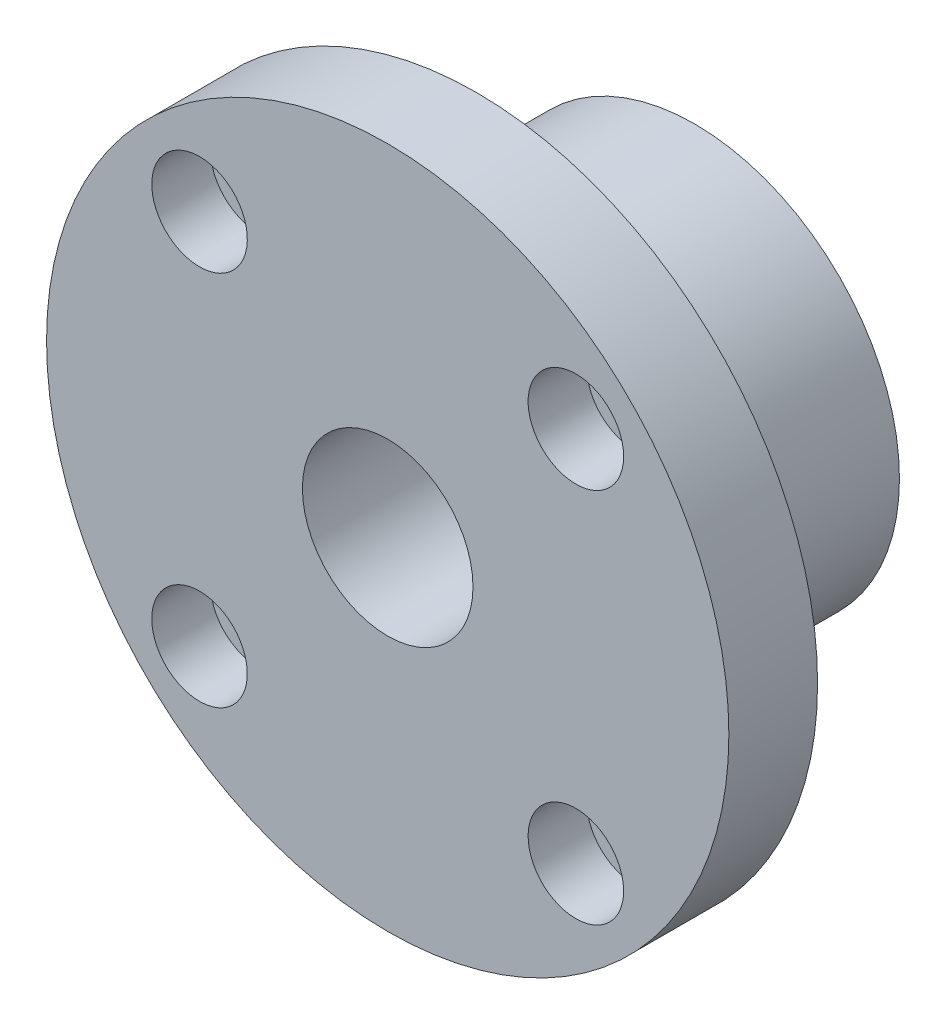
ISO-10303-21;
HEADER;
FILE_DESCRIPTION(('STEP AP214'),'2;1');
FILE_NAME('part.step','',(''),(''),'','','');
FILE_SCHEMA(('AUTOMOTIVE_DESIGN { 1 0 10303 214 1 1 1 1 }'));
ENDSEC;
DATA;
#1=APPLICATION_CONTEXT('core data for automotive mechanical design processes');
#2=APPLICATION_PROTOCOL_DEFINITION('international standard','automotive_design',2000,#1);
#3=PRODUCT_CONTEXT('',#1,'mechanical');
#4=PRODUCT('Part','Part','',(#3));
#5=PRODUCT_RELATED_PRODUCT_CATEGORY('part','',(#4));
#6=PRODUCT_DEFINITION_FORMATION('','',#4);
#7=PRODUCT_DEFINITION_CONTEXT('part definition',#1,'design');
#8=PRODUCT_DEFINITION('design','',#6,#7);
#9=PRODUCT_DEFINITION_SHAPE('','',#8);
#10=(LENGTH_UNIT() NAMED_UNIT(*) SI_UNIT(.MILLI.,.METRE.));
#11=(NAMED_UNIT(*) PLANE_ANGLE_UNIT() SI_UNIT($,.RADIAN.));
#12=(NAMED_UNIT(*) SI_UNIT($,.STERADIAN.) SOLID_ANGLE_UNIT());
#13=UNCERTAINTY_MEASURE_WITH_UNIT(LENGTH_MEASURE(1.E-05),#10,'distance_accuracy_value','');
#14=(GEOMETRIC_REPRESENTATION_CONTEXT(3) GLOBAL_UNCERTAINTY_ASSIGNED_CONTEXT((#13)) GLOBAL_UNIT_ASSIGNED_CONTEXT((#10,
#11,#12)) REPRESENTATION_CONTEXT('',''));
#15=CARTESIAN_POINT('',(0.,0.,0.));
#16=DIRECTION('',(0.,0.,1.));
#17=DIRECTION('',(1.,0.,0.));
#18=AXIS2_PLACEMENT_3D('',#15,#16,#17);
#19=CARTESIAN_POINT('',(0.,0.,0.));
#20=DIRECTION('',(0.,0.,1.));
#21=DIRECTION('',(1.,0.,0.));
#22=AXIS2_PLACEMENT_3D('',#19,#20,#21);
#23=PLANE('',#22);
#24=CARTESIAN_POINT('',(0.,0.,0.));
#25=DIRECTION('',(0.,0.,1.));
#26=DIRECTION('',(1.,0.,0.));
#27=AXIS2_PLACEMENT_3D('',#24,#25,#26);
#28=CIRCLE('',#27,50.);
#29=CARTESIAN_POINT('',(50.,0.,0.));
#30=VERTEX_POINT('',#29);
#31=EDGE_CURVE('E23',#30,#30,#28,.T.);
#32=ORIENTED_EDGE('',*,*,#31,.F.);
#33=EDGE_LOOP('',(#32));
#34=FACE_BOUND('',#33,.T.);
#35=CARTESIAN_POINT('',(27.5771644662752,27.5771644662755,0.));
#36=DIRECTION('',(0.,0.,1.));
#37=DIRECTION('',(1.,0.,0.));
#38=AXIS2_PLACEMENT_3D('',#35,#36,#37);
#39=CIRCLE('',#38,5.);
#40=CARTESIAN_POINT('',(32.5771644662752,27.5771644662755,0.));
#41=VERTEX_POINT('',#40);
#42=EDGE_CURVE('E35',#41,#41,#39,.T.);
#43=ORIENTED_EDGE('',*,*,#42,.T.);
#44=EDGE_LOOP('',(#43));
#45=FACE_BOUND('',#44,.T.);
#46=CARTESIAN_POINT('',(27.5771644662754,-27.5771644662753,0.));
#47=DIRECTION('',(0.,0.,1.));
#48=DIRECTION('',(0.,-1.,0.));
#49=AXIS2_PLACEMENT_3D('',#46,#47,#48);
#50=CIRCLE('',#49,5.);
#51=CARTESIAN_POINT('',(27.5771644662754,-32.5771644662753,0.));
#52=VERTEX_POINT('',#51);
#53=EDGE_CURVE('E75',#52,#52,#50,.T.);
#54=ORIENTED_EDGE('',*,*,#53,.T.);
#55=EDGE_LOOP('',(#54));
#56=FACE_BOUND('',#55,.T.);
#57=CARTESIAN_POINT('',(-27.5771644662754,-27.5771644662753,0.));
#58=DIRECTION('',(0.,0.,1.));
#59=DIRECTION('',(-1.,0.,0.));
#60=AXIS2_PLACEMENT_3D('',#57,#58,#59);
#61=CIRCLE('',#60,5.);
#62=CARTESIAN_POINT('',(-32.5771644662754,-27.5771644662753,0.));
#63=VERTEX_POINT('',#62);
#64=EDGE_CURVE('E72',#63,#63,#61,.T.);
#65=ORIENTED_EDGE('',*,*,#64,.T.);
#66=EDGE_LOOP('',(#65));
#67=FACE_BOUND('',#66,.T.);
#68=CARTESIAN_POINT('',(-27.5771644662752,27.5771644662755,0.));
#69=DIRECTION('',(0.,0.,1.));
#70=DIRECTION('',(0.,1.,0.));
#71=AXIS2_PLACEMENT_3D('',#68,#69,#70);
#72=CIRCLE('',#71,5.);
#73=CARTESIAN_POINT('',(-27.5771644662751,32.5771644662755,0.));
#74=VERTEX_POINT('',#73);
#75=EDGE_CURVE('E40',#74,#74,#72,.T.);
#76=ORIENTED_EDGE('',*,*,#75,.T.);
#77=EDGE_LOOP('',(#76));
#78=FACE_BOUND('',#77,.T.);
#79=CARTESIAN_POINT('',(0.,0.,0.));
#80=DIRECTION('',(0.,0.,1.));
#81=DIRECTION('',(1.,0.,0.));
#82=AXIS2_PLACEMENT_3D('',#79,#80,#81);
#83=CIRCLE('',#82,30.);
#84=CARTESIAN_POINT('',(30.,0.,0.));
#85=VERTEX_POINT('',#84);
#86=EDGE_CURVE('E8',#85,#85,#83,.F.);
#87=ORIENTED_EDGE('',*,*,#86,.F.);
#88=EDGE_LOOP('',(#87));
#89=FACE_BOUND('',#88,.T.);
#90=ADVANCED_FACE('F12',(#34,#45,#56,#67,#78,#89),#23,.F.);
#91=CARTESIAN_POINT('',(-27.5771644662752,27.5771644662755,0.));
#92=DIRECTION('',(0.,0.,1.));
#93=DIRECTION('',(1.,0.,0.));
#94=AXIS2_PLACEMENT_3D('',#91,#92,#93);
#95=CYLINDRICAL_SURFACE('',#94,5.);
#96=ORIENTED_EDGE('',*,*,#75,.F.);
#97=EDGE_LOOP('',(#96));
#98=FACE_BOUND('',#97,.T.);
#99=CARTESIAN_POINT('',(-27.5771644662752,27.5771644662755,4.4));
#100=DIRECTION('',(0.,0.,1.));
#101=DIRECTION('',(1.,0.,0.));
#102=AXIS2_PLACEMENT_3D('',#99,#100,#101);
#103=CIRCLE('',#102,5.);
#104=CARTESIAN_POINT('',(-22.5771644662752,27.5771644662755,4.4));
#105=VERTEX_POINT('',#104);
#106=EDGE_CURVE('E46',#105,#105,#103,.F.);
#107=ORIENTED_EDGE('',*,*,#106,.F.);
#108=EDGE_LOOP('',(#107));
#109=FACE_BOUND('',#108,.T.);
#110=ADVANCED_FACE('F120',(#98,#109),#95,.F.);
#111=CARTESIAN_POINT('',(-27.5771644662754,-27.5771644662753,0.));
#112=DIRECTION('',(0.,0.,1.));
#113=DIRECTION('',(1.,0.,0.));
#114=AXIS2_PLACEMENT_3D('',#111,#112,#113);
#115=CYLINDRICAL_SURFACE('',#114,5.);
#116=ORIENTED_EDGE('',*,*,#64,.F.);
#117=EDGE_LOOP('',(#116));
#118=FACE_BOUND('',#117,.T.);
#119=CARTESIAN_POINT('',(-27.5771644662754,-27.5771644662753,4.4));
#120=DIRECTION('',(0.,0.,1.));
#121=DIRECTION('',(1.,0.,0.));
#122=AXIS2_PLACEMENT_3D('',#119,#120,#121);
#123=CIRCLE('',#122,5.);
#124=CARTESIAN_POINT('',(-22.5771644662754,-27.5771644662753,4.4));
#125=VERTEX_POINT('',#124);
#126=EDGE_CURVE('E42',#125,#125,#123,.F.);
#127=ORIENTED_EDGE('',*,*,#126,.F.);
#128=EDGE_LOOP('',(#127));
#129=FACE_BOUND('',#128,.T.);
#130=ADVANCED_FACE('F126',(#118,#129),#115,.F.);
#131=CARTESIAN_POINT('',(27.5771644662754,-27.5771644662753,0.));
#132=DIRECTION('',(0.,0.,1.));
#133=DIRECTION('',(1.,0.,0.));
#134=AXIS2_PLACEMENT_3D('',#131,#132,#133);
#135=CYLINDRICAL_SURFACE('',#134,5.);
#136=ORIENTED_EDGE('',*,*,#53,.F.);
#137=EDGE_LOOP('',(#136));
#138=FACE_BOUND('',#137,.T.);
#139=CARTESIAN_POINT('',(27.5771644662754,-27.5771644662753,4.4));
#140=DIRECTION('',(0.,0.,1.));
#141=DIRECTION('',(1.,0.,0.));
#142=AXIS2_PLACEMENT_3D('',#139,#140,#141);
#143=CIRCLE('',#142,5.);
#144=CARTESIAN_POINT('',(32.5771644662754,-27.5771644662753,4.4));
#145=VERTEX_POINT('',#144);
#146=EDGE_CURVE('E37',#145,#145,#143,.F.);
#147=ORIENTED_EDGE('',*,*,#146,.F.);
#148=EDGE_LOOP('',(#147));
#149=FACE_BOUND('',#148,.T.);
#150=ADVANCED_FACE('F137',(#138,#149),#135,.F.);
#151=CARTESIAN_POINT('',(27.5771644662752,27.5771644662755,0.));
#152=DIRECTION('',(0.,0.,1.));
#153=DIRECTION('',(1.,0.,0.));
#154=AXIS2_PLACEMENT_3D('',#151,#152,#153);
#155=CYLINDRICAL_SURFACE('',#154,5.);
#156=ORIENTED_EDGE('',*,*,#42,.F.);
#157=EDGE_LOOP('',(#156));
#158=FACE_BOUND('',#157,.T.);
#159=CARTESIAN_POINT('',(27.5771644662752,27.5771644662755,4.4));
#160=DIRECTION('',(0.,0.,1.));
#161=DIRECTION('',(1.,0.,0.));
#162=AXIS2_PLACEMENT_3D('',#159,#160,#161);
#163=CIRCLE('',#162,5.);
#164=CARTESIAN_POINT('',(32.5771644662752,27.5771644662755,4.4));
#165=VERTEX_POINT('',#164);
#166=EDGE_CURVE('E32',#165,#165,#163,.F.);
#167=ORIENTED_EDGE('',*,*,#166,.F.);
#168=EDGE_LOOP('',(#167));
#169=FACE_BOUND('',#168,.T.);
#170=ADVANCED_FACE('F92',(#158,#169),#155,.F.);
#171=CARTESIAN_POINT('',(0.,0.,13.));
#172=DIRECTION('',(0.,0.,1.));
#173=DIRECTION('',(1.,0.,0.));
#174=AXIS2_PLACEMENT_3D('',#171,#172,#173);
#175=PLANE('',#174);
#176=CARTESIAN_POINT('',(0.,0.,13.));
#177=DIRECTION('',(0.,0.,1.));
#178=DIRECTION('',(1.,0.,0.));
#179=AXIS2_PLACEMENT_3D('',#176,#177,#178);
#180=CIRCLE('',#179,12.5);
#181=CARTESIAN_POINT('',(12.5,0.,13.));
#182=VERTEX_POINT('',#181);
#183=EDGE_CURVE('E28',#182,#182,#180,.T.);
#184=ORIENTED_EDGE('',*,*,#183,.F.);
#185=EDGE_LOOP('',(#184));
#186=FACE_BOUND('',#185,.T.);
#187=CARTESIAN_POINT('',(0.,0.,13.));
#188=DIRECTION('',(0.,0.,1.));
#189=DIRECTION('',(1.,0.,0.));
#190=AXIS2_PLACEMENT_3D('',#187,#188,#189);
#191=CIRCLE('',#190,50.);
#192=CARTESIAN_POINT('',(50.,0.,13.));
#193=VERTEX_POINT('',#192);
#194=EDGE_CURVE('E19',#193,#193,#191,.T.);
#195=ORIENTED_EDGE('',*,*,#194,.T.);
#196=EDGE_LOOP('',(#195));
#197=FACE_BOUND('',#196,.T.);
#198=CARTESIAN_POINT('',(27.5771644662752,27.5771644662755,13.));
#199=DIRECTION('',(0.,0.,1.));
#200=DIRECTION('',(1.,0.,0.));
#201=AXIS2_PLACEMENT_3D('',#198,#199,#200);
#202=CIRCLE('',#201,7.);
#203=CARTESIAN_POINT('',(34.5771644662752,27.5771644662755,13.));
#204=VERTEX_POINT('',#203);
#205=EDGE_CURVE('E78',#204,#204,#202,.T.);
#206=ORIENTED_EDGE('',*,*,#205,.F.);
#207=EDGE_LOOP('',(#206));
#208=FACE_BOUND('',#207,.T.);
#209=CARTESIAN_POINT('',(27.5771644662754,-27.5771644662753,13.));
#210=DIRECTION('',(0.,0.,1.));
#211=DIRECTION('',(0.,-1.,0.));
#212=AXIS2_PLACEMENT_3D('',#209,#210,#211);
#213=CIRCLE('',#212,7.);
#214=CARTESIAN_POINT('',(27.5771644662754,-34.5771644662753,13.));
#215=VERTEX_POINT('',#214);
#216=EDGE_CURVE('E44',#215,#215,#213,.T.);
#217=ORIENTED_EDGE('',*,*,#216,.F.);
#218=EDGE_LOOP('',(#217));
#219=FACE_BOUND('',#218,.T.);
#220=CARTESIAN_POINT('',(-27.5771644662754,-27.5771644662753,13.));
#221=DIRECTION('',(0.,0.,1.));
#222=DIRECTION('',(-1.,0.,0.));
#223=AXIS2_PLACEMENT_3D('',#220,#221,#222);
#224=CIRCLE('',#223,7.);
#225=CARTESIAN_POINT('',(-34.5771644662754,-27.5771644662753,13.));
#226=VERTEX_POINT('',#225);
#227=EDGE_CURVE('E48',#226,#226,#224,.T.);
#228=ORIENTED_EDGE('',*,*,#227,.F.);
#229=EDGE_LOOP('',(#228));
#230=FACE_BOUND('',#229,.T.);
#231=CARTESIAN_POINT('',(-27.5771644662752,27.5771644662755,13.));
#232=DIRECTION('',(0.,0.,1.));
#233=DIRECTION('',(0.,1.,0.));
#234=AXIS2_PLACEMENT_3D('',#231,#232,#233);
#235=CIRCLE('',#234,7.);
#236=CARTESIAN_POINT('',(-27.5771644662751,34.5771644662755,13.));
#237=VERTEX_POINT('',#236);
#238=EDGE_CURVE('E55',#237,#237,#235,.T.);
#239=ORIENTED_EDGE('',*,*,#238,.F.);
#240=EDGE_LOOP('',(#239));
#241=FACE_BOUND('',#240,.T.);
#242=ADVANCED_FACE('F90',(#186,#197,#208,#219,#230,#241),#175,.T.);
#243=CARTESIAN_POINT('',(0.,0.,13.));
#244=DIRECTION('',(0.,0.,-1.));
#245=DIRECTION('',(-1.,0.,0.));
#246=AXIS2_PLACEMENT_3D('',#243,#244,#245);
#247=CYLINDRICAL_SURFACE('',#246,50.);
#248=ORIENTED_EDGE('',*,*,#194,.F.);
#249=EDGE_LOOP('',(#248));
#250=FACE_BOUND('',#249,.T.);
#251=ORIENTED_EDGE('',*,*,#31,.T.);
#252=EDGE_LOOP('',(#251));
#253=FACE_BOUND('',#252,.T.);
#254=ADVANCED_FACE('F14',(#250,#253),#247,.T.);
#255=CARTESIAN_POINT('',(0.,0.,13.));
#256=DIRECTION('',(0.,0.,-1.));
#257=DIRECTION('',(-1.,0.,0.));
#258=AXIS2_PLACEMENT_3D('',#255,#256,#257);
#259=CYLINDRICAL_SURFACE('',#258,12.5);
#260=ORIENTED_EDGE('',*,*,#183,.T.);
#261=EDGE_LOOP('',(#260));
#262=FACE_BOUND('',#261,.T.);
#263=CARTESIAN_POINT('',(0.,0.,-32.));
#264=DIRECTION('',(0.,0.,-1.));
#265=DIRECTION('',(-1.,0.,0.));
#266=AXIS2_PLACEMENT_3D('',#263,#264,#265);
#267=CIRCLE('',#266,12.5);
#268=CARTESIAN_POINT('',(-12.5,0.,-32.));
#269=VERTEX_POINT('',#268);
#270=EDGE_CURVE('E292',#269,#269,#267,.T.);
#271=ORIENTED_EDGE('',*,*,#270,.T.);
#272=EDGE_LOOP('',(#271));
#273=FACE_BOUND('',#272,.T.);
#274=ADVANCED_FACE('F87',(#262,#273),#259,.F.);
#275=CARTESIAN_POINT('',(27.5771644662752,27.5771644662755,4.4));
#276=DIRECTION('',(0.,0.,1.));
#277=DIRECTION('',(1.,0.,0.));
#278=AXIS2_PLACEMENT_3D('',#275,#276,#277);
#279=PLANE('',#278);
#280=CARTESIAN_POINT('',(27.5771644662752,27.5771644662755,4.4));
#281=DIRECTION('',(0.,0.,1.));
#282=DIRECTION('',(1.,0.,0.));
#283=AXIS2_PLACEMENT_3D('',#280,#281,#282);
#284=CIRCLE('',#283,7.);
#285=CARTESIAN_POINT('',(34.5771644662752,27.5771644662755,4.4));
#286=VERTEX_POINT('',#285);
#287=EDGE_CURVE('E36',#286,#286,#284,.T.);
#288=ORIENTED_EDGE('',*,*,#287,.T.);
#289=EDGE_LOOP('',(#288));
#290=FACE_BOUND('',#289,.T.);
#291=ORIENTED_EDGE('',*,*,#166,.T.);
#292=EDGE_LOOP('',(#291));
#293=FACE_BOUND('',#292,.T.);
#294=ADVANCED_FACE('F134',(#290,#293),#279,.T.);
#295=CARTESIAN_POINT('',(27.5771644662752,27.5771644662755,4.4));
#296=DIRECTION('',(0.,0.,1.));
#297=DIRECTION('',(1.,0.,0.));
#298=AXIS2_PLACEMENT_3D('',#295,#296,#297);
#299=CYLINDRICAL_SURFACE('',#298,7.);
#300=ORIENTED_EDGE('',*,*,#287,.F.);
#301=EDGE_LOOP('',(#300));
#302=FACE_BOUND('',#301,.T.);
#303=ORIENTED_EDGE('',*,*,#205,.T.);
#304=EDGE_LOOP('',(#303));
#305=FACE_BOUND('',#304,.T.);
#306=ADVANCED_FACE('F139',(#302,#305),#299,.F.);
#307=CARTESIAN_POINT('',(27.5771644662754,-27.5771644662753,4.4));
#308=DIRECTION('',(0.,0.,1.));
#309=DIRECTION('',(0.,-1.,0.));
#310=AXIS2_PLACEMENT_3D('',#307,#308,#309);
#311=PLANE('',#310);
#312=CARTESIAN_POINT('',(27.5771644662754,-27.5771644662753,4.4));
#313=DIRECTION('',(0.,0.,1.));
#314=DIRECTION('',(0.,-1.,0.));
#315=AXIS2_PLACEMENT_3D('',#312,#313,#314);
#316=CIRCLE('',#315,7.);
#317=CARTESIAN_POINT('',(27.5771644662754,-34.5771644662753,4.4));
#318=VERTEX_POINT('',#317);
#319=EDGE_CURVE('E41',#318,#318,#316,.T.);
#320=ORIENTED_EDGE('',*,*,#319,.T.);
#321=EDGE_LOOP('',(#320));
#322=FACE_BOUND('',#321,.T.);
#323=ORIENTED_EDGE('',*,*,#146,.T.);
#324=EDGE_LOOP('',(#323));
#325=FACE_BOUND('',#324,.T.);
#326=ADVANCED_FACE('F142',(#322,#325),#311,.T.);
#327=CARTESIAN_POINT('',(27.5771644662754,-27.5771644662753,4.4));
#328=DIRECTION('',(0.,0.,1.));
#329=DIRECTION('',(1.,0.,0.));
#330=AXIS2_PLACEMENT_3D('',#327,#328,#329);
#331=CYLINDRICAL_SURFACE('',#330,7.);
#332=ORIENTED_EDGE('',*,*,#319,.F.);
#333=EDGE_LOOP('',(#332));
#334=FACE_BOUND('',#333,.T.);
#335=ORIENTED_EDGE('',*,*,#216,.T.);
#336=EDGE_LOOP('',(#335));
#337=FACE_BOUND('',#336,.T.);
#338=ADVANCED_FACE('F153',(#334,#337),#331,.F.);
#339=CARTESIAN_POINT('',(-27.5771644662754,-27.5771644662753,4.4));
#340=DIRECTION('',(0.,0.,1.));
#341=DIRECTION('',(-1.,0.,0.));
#342=AXIS2_PLACEMENT_3D('',#339,#340,#341);
#343=PLANE('',#342);
#344=CARTESIAN_POINT('',(-27.5771644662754,-27.5771644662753,4.4));
#345=DIRECTION('',(0.,0.,1.));
#346=DIRECTION('',(-1.,0.,0.));
#347=AXIS2_PLACEMENT_3D('',#344,#345,#346);
#348=CIRCLE('',#347,7.);
#349=CARTESIAN_POINT('',(-34.5771644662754,-27.5771644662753,4.4));
#350=VERTEX_POINT('',#349);
#351=EDGE_CURVE('E45',#350,#350,#348,.T.);
#352=ORIENTED_EDGE('',*,*,#351,.T.);
#353=EDGE_LOOP('',(#352));
#354=FACE_BOUND('',#353,.T.);
#355=ORIENTED_EDGE('',*,*,#126,.T.);
#356=EDGE_LOOP('',(#355));
#357=FACE_BOUND('',#356,.T.);
#358=ADVANCED_FACE('F156',(#354,#357),#343,.T.);
#359=CARTESIAN_POINT('',(-27.5771644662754,-27.5771644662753,4.4));
#360=DIRECTION('',(0.,0.,1.));
#361=DIRECTION('',(1.,0.,0.));
#362=AXIS2_PLACEMENT_3D('',#359,#360,#361);
#363=CYLINDRICAL_SURFACE('',#362,7.);
#364=ORIENTED_EDGE('',*,*,#351,.F.);
#365=EDGE_LOOP('',(#364));
#366=FACE_BOUND('',#365,.T.);
#367=ORIENTED_EDGE('',*,*,#227,.T.);
#368=EDGE_LOOP('',(#367));
#369=FACE_BOUND('',#368,.T.);
#370=ADVANCED_FACE('F116',(#366,#369),#363,.F.);
#371=CARTESIAN_POINT('',(-27.5771644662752,27.5771644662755,4.4));
#372=DIRECTION('',(0.,0.,1.));
#373=DIRECTION('',(0.,1.,0.));
#374=AXIS2_PLACEMENT_3D('',#371,#372,#373);
#375=PLANE('',#374);
#376=CARTESIAN_POINT('',(-27.5771644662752,27.5771644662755,4.4));
#377=DIRECTION('',(0.,0.,1.));
#378=DIRECTION('',(0.,1.,0.));
#379=AXIS2_PLACEMENT_3D('',#376,#377,#378);
#380=CIRCLE('',#379,7.);
#381=CARTESIAN_POINT('',(-27.5771644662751,34.5771644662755,4.4));
#382=VERTEX_POINT('',#381);
#383=EDGE_CURVE('E49',#382,#382,#380,.T.);
#384=ORIENTED_EDGE('',*,*,#383,.T.);
#385=EDGE_LOOP('',(#384));
#386=FACE_BOUND('',#385,.T.);
#387=ORIENTED_EDGE('',*,*,#106,.T.);
#388=EDGE_LOOP('',(#387));
#389=FACE_BOUND('',#388,.T.);
#390=ADVANCED_FACE('F105',(#386,#389),#375,.T.);
#391=CARTESIAN_POINT('',(-27.5771644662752,27.5771644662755,4.4));
#392=DIRECTION('',(0.,0.,1.));
#393=DIRECTION('',(1.,0.,0.));
#394=AXIS2_PLACEMENT_3D('',#391,#392,#393);
#395=CYLINDRICAL_SURFACE('',#394,7.);
#396=ORIENTED_EDGE('',*,*,#383,.F.);
#397=EDGE_LOOP('',(#396));
#398=FACE_BOUND('',#397,.T.);
#399=ORIENTED_EDGE('',*,*,#238,.T.);
#400=EDGE_LOOP('',(#399));
#401=FACE_BOUND('',#400,.T.);
#402=ADVANCED_FACE('F102',(#398,#401),#395,.F.);
#403=CARTESIAN_POINT('',(0.,0.,-32.));
#404=DIRECTION('',(0.,0.,1.));
#405=DIRECTION('',(1.,0.,0.));
#406=AXIS2_PLACEMENT_3D('',#403,#404,#405);
#407=CYLINDRICAL_SURFACE('',#406,30.);
#408=CARTESIAN_POINT('',(0.,0.,-32.));
#409=DIRECTION('',(0.,0.,-1.));
#410=DIRECTION('',(-1.,0.,0.));
#411=AXIS2_PLACEMENT_3D('',#408,#409,#410);
#412=CIRCLE('',#411,30.);
#413=CARTESIAN_POINT('',(-30.,0.,-32.));
#414=VERTEX_POINT('',#413);
#415=EDGE_CURVE('E60',#414,#414,#412,.T.);
#416=ORIENTED_EDGE('',*,*,#415,.F.);
#417=EDGE_LOOP('',(#416));
#418=FACE_BOUND('',#417,.T.);
#419=ORIENTED_EDGE('',*,*,#86,.T.);
#420=EDGE_LOOP('',(#419));
#421=FACE_BOUND('',#420,.T.);
#422=ADVANCED_FACE('F104',(#418,#421),#407,.T.);
#423=CARTESIAN_POINT('',(0.,0.,-32.));
#424=DIRECTION('',(0.,0.,-1.));
#425=DIRECTION('',(-1.,0.,0.));
#426=AXIS2_PLACEMENT_3D('',#423,#424,#425);
#427=PLANE('',#426);
#428=ORIENTED_EDGE('',*,*,#415,.T.);
#429=EDGE_LOOP('',(#428));
#430=FACE_BOUND('',#429,.T.);
#431=ORIENTED_EDGE('',*,*,#270,.F.);
#432=EDGE_LOOP('',(#431));
#433=FACE_BOUND('',#432,.T.);
#434=ADVANCED_FACE('F113',(#430,#433),#427,.T.);
#435=CLOSED_SHELL('',(#90,#110,#130,#150,#170,#242,#254,#274,#294,#306,#326,#338,#358,#370,#390,
#402,#422,#434));
#436=MANIFOLD_SOLID_BREP('B1',#435);
#437=ADVANCED_BREP_SHAPE_REPRESENTATION('',(#18,#436),#14);
#438=SHAPE_DEFINITION_REPRESENTATION(#9,#437);
ENDSEC;
END-ISO-10303-21;
